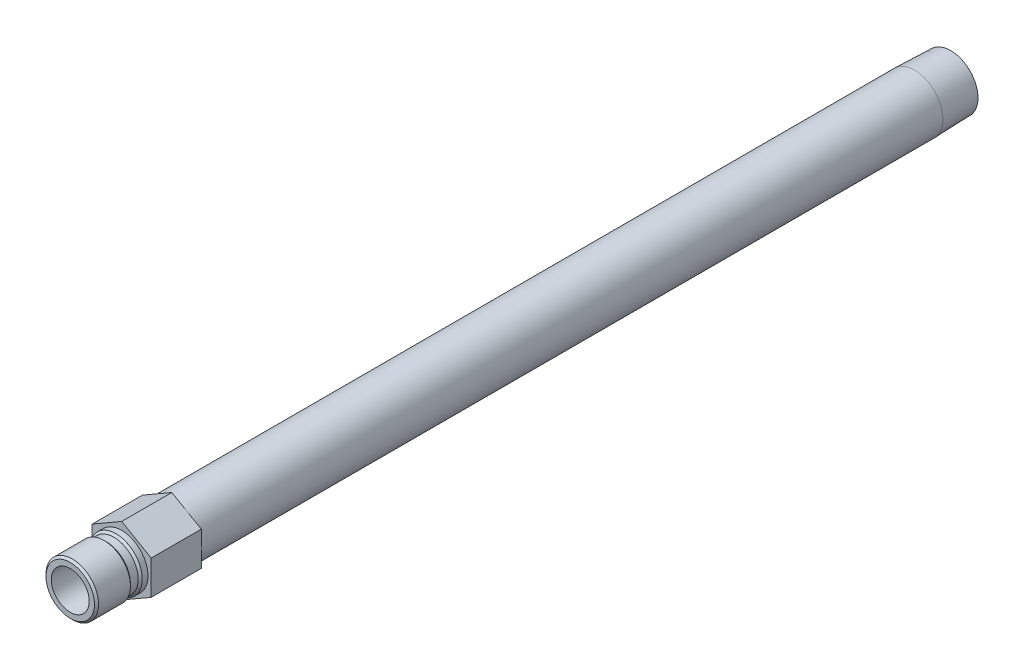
ISO-10303-21;
HEADER;
FILE_DESCRIPTION(('STEP AP214'),'2;1');
FILE_NAME('part.step','',(''),(''),'','','');
FILE_SCHEMA(('AUTOMOTIVE_DESIGN { 1 0 10303 214 1 1 1 1 }'));
ENDSEC;
DATA;
#1=APPLICATION_CONTEXT('core data for automotive mechanical design processes');
#2=APPLICATION_PROTOCOL_DEFINITION('international standard','automotive_design',2000,#1);
#3=PRODUCT_CONTEXT('',#1,'mechanical');
#4=PRODUCT('Part','Part','',(#3));
#5=PRODUCT_RELATED_PRODUCT_CATEGORY('part','',(#4));
#6=PRODUCT_DEFINITION_FORMATION('','',#4);
#7=PRODUCT_DEFINITION_CONTEXT('part definition',#1,'design');
#8=PRODUCT_DEFINITION('design','',#6,#7);
#9=PRODUCT_DEFINITION_SHAPE('','',#8);
#10=(LENGTH_UNIT() NAMED_UNIT(*) SI_UNIT(.MILLI.,.METRE.));
#11=(NAMED_UNIT(*) PLANE_ANGLE_UNIT() SI_UNIT($,.RADIAN.));
#12=(NAMED_UNIT(*) SI_UNIT($,.STERADIAN.) SOLID_ANGLE_UNIT());
#13=UNCERTAINTY_MEASURE_WITH_UNIT(LENGTH_MEASURE(1.E-05),#10,'distance_accuracy_value','');
#14=(GEOMETRIC_REPRESENTATION_CONTEXT(3) GLOBAL_UNCERTAINTY_ASSIGNED_CONTEXT((#13)) GLOBAL_UNIT_ASSIGNED_CONTEXT((#10,
#11,#12)) REPRESENTATION_CONTEXT('',''));
#15=CARTESIAN_POINT('',(0.,0.,0.));
#16=DIRECTION('',(0.,0.,1.));
#17=DIRECTION('',(1.,0.,0.));
#18=AXIS2_PLACEMENT_3D('',#15,#16,#17);
#19=CARTESIAN_POINT('',(0.,0.,0.));
#20=DIRECTION('',(0.,0.,-1.));
#21=DIRECTION('',(0.,1.,0.));
#22=AXIS2_PLACEMENT_3D('',#19,#20,#21);
#23=CYLINDRICAL_SURFACE('',#22,7.112);
#24=CARTESIAN_POINT('',(0.,0.,1.524));
#25=DIRECTION('',(0.,0.,-1.));
#26=DIRECTION('',(0.,1.,0.));
#27=AXIS2_PLACEMENT_3D('',#24,#25,#26);
#28=CIRCLE('',#27,7.112);
#29=CARTESIAN_POINT('',(0.,7.112,1.524));
#30=VERTEX_POINT('',#29);
#31=EDGE_CURVE('E147',#30,#30,#28,.T.);
#32=ORIENTED_EDGE('',*,*,#31,.T.);
#33=EDGE_LOOP('',(#32));
#34=FACE_BOUND('',#33,.T.);
#35=CARTESIAN_POINT('',(0.,0.,19.304));
#36=DIRECTION('',(0.,0.,-1.));
#37=DIRECTION('',(0.,1.,0.));
#38=AXIS2_PLACEMENT_3D('',#35,#36,#37);
#39=CIRCLE('',#38,7.112);
#40=CARTESIAN_POINT('',(0.,7.112,19.304));
#41=VERTEX_POINT('',#40);
#42=EDGE_CURVE('E42',#41,#41,#39,.T.);
#43=ORIENTED_EDGE('',*,*,#42,.F.);
#44=EDGE_LOOP('',(#43));
#45=FACE_BOUND('',#44,.T.);
#46=ADVANCED_FACE('F33',(#34,#45),#23,.F.);
#47=CARTESIAN_POINT('',(0.,7.112,19.304));
#48=DIRECTION('',(0.,0.,1.));
#49=DIRECTION('',(0.,-1.,0.));
#50=AXIS2_PLACEMENT_3D('',#47,#48,#49);
#51=PLANE('',#50);
#52=ORIENTED_EDGE('',*,*,#42,.T.);
#53=EDGE_LOOP('',(#52));
#54=FACE_BOUND('',#53,.T.);
#55=CARTESIAN_POINT('',(0.,0.,19.304));
#56=DIRECTION('',(0.,0.,-1.));
#57=DIRECTION('',(0.,1.,0.));
#58=AXIS2_PLACEMENT_3D('',#55,#56,#57);
#59=CIRCLE('',#58,9.0932);
#60=CARTESIAN_POINT('',(0.,9.0932,19.304));
#61=VERTEX_POINT('',#60);
#62=EDGE_CURVE('E180',#61,#61,#59,.T.);
#63=ORIENTED_EDGE('',*,*,#62,.F.);
#64=EDGE_LOOP('',(#63));
#65=FACE_BOUND('',#64,.T.);
#66=ADVANCED_FACE('F186',(#54,#65),#51,.T.);
#67=CARTESIAN_POINT('',(0.,0.,18.542));
#68=DIRECTION('',(0.,0.,-1.));
#69=DIRECTION('',(0.,1.,0.));
#70=AXIS2_PLACEMENT_3D('',#67,#68,#69);
#71=CONICAL_SURFACE('',#70,9.8552,0.785398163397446);
#72=ORIENTED_EDGE('',*,*,#62,.T.);
#73=EDGE_LOOP('',(#72));
#74=FACE_BOUND('',#73,.T.);
#75=CARTESIAN_POINT('',(0.,0.,18.542));
#76=DIRECTION('',(0.,0.,-1.));
#77=DIRECTION('',(0.,1.,0.));
#78=AXIS2_PLACEMENT_3D('',#75,#76,#77);
#79=CIRCLE('',#78,9.8552);
#80=CARTESIAN_POINT('',(0.,9.8552,18.542));
#81=VERTEX_POINT('',#80);
#82=EDGE_CURVE('E177',#81,#81,#79,.T.);
#83=ORIENTED_EDGE('',*,*,#82,.F.);
#84=EDGE_LOOP('',(#83));
#85=FACE_BOUND('',#84,.T.);
#86=ADVANCED_FACE('F194',(#74,#85),#71,.T.);
#87=CARTESIAN_POINT('',(0.,0.,0.));
#88=DIRECTION('',(0.,0.,-1.));
#89=DIRECTION('',(0.,1.,0.));
#90=AXIS2_PLACEMENT_3D('',#87,#88,#89);
#91=CYLINDRICAL_SURFACE('',#90,9.8552);
#92=ORIENTED_EDGE('',*,*,#82,.T.);
#93=EDGE_LOOP('',(#92));
#94=FACE_BOUND('',#93,.T.);
#95=CARTESIAN_POINT('',(0.,0.,6.5786));
#96=DIRECTION('',(0.,0.,-1.));
#97=DIRECTION('',(0.,1.,0.));
#98=AXIS2_PLACEMENT_3D('',#95,#96,#97);
#99=CIRCLE('',#98,9.8552);
#100=CARTESIAN_POINT('',(0.,9.8552,6.5786));
#101=VERTEX_POINT('',#100);
#102=EDGE_CURVE('E174',#101,#101,#99,.T.);
#103=ORIENTED_EDGE('',*,*,#102,.F.);
#104=EDGE_LOOP('',(#103));
#105=FACE_BOUND('',#104,.T.);
#106=ADVANCED_FACE('F249',(#94,#105),#91,.T.);
#107=CARTESIAN_POINT('',(0.,0.,5.8166));
#108=DIRECTION('',(0.,0.,1.));
#109=DIRECTION('',(0.,-1.,0.));
#110=AXIS2_PLACEMENT_3D('',#107,#108,#109);
#111=CONICAL_SURFACE('',#110,9.0932,0.785398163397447);
#112=ORIENTED_EDGE('',*,*,#102,.T.);
#113=EDGE_LOOP('',(#112));
#114=FACE_BOUND('',#113,.T.);
#115=CARTESIAN_POINT('',(0.,0.,5.8166));
#116=DIRECTION('',(0.,0.,-1.));
#117=DIRECTION('',(0.,1.,0.));
#118=AXIS2_PLACEMENT_3D('',#115,#116,#117);
#119=CIRCLE('',#118,9.0932);
#120=CARTESIAN_POINT('',(0.,9.0932,5.8166));
#121=VERTEX_POINT('',#120);
#122=EDGE_CURVE('E171',#121,#121,#119,.T.);
#123=ORIENTED_EDGE('',*,*,#122,.F.);
#124=EDGE_LOOP('',(#123));
#125=FACE_BOUND('',#124,.T.);
#126=ADVANCED_FACE('F245',(#114,#125),#111,.T.);
#127=CARTESIAN_POINT('',(0.,0.,0.));
#128=DIRECTION('',(0.,0.,-1.));
#129=DIRECTION('',(0.,1.,0.));
#130=AXIS2_PLACEMENT_3D('',#127,#128,#129);
#131=CYLINDRICAL_SURFACE('',#130,9.0932);
#132=ORIENTED_EDGE('',*,*,#122,.T.);
#133=EDGE_LOOP('',(#132));
#134=FACE_BOUND('',#133,.T.);
#135=CARTESIAN_POINT('',(0.,0.,2.921));
#136=DIRECTION('',(0.,0.,-1.));
#137=DIRECTION('',(0.,1.,0.));
#138=AXIS2_PLACEMENT_3D('',#135,#136,#137);
#139=CIRCLE('',#138,9.0932);
#140=CARTESIAN_POINT('',(0.,9.0932,2.921));
#141=VERTEX_POINT('',#140);
#142=EDGE_CURVE('E168',#141,#141,#139,.T.);
#143=ORIENTED_EDGE('',*,*,#142,.F.);
#144=EDGE_LOOP('',(#143));
#145=FACE_BOUND('',#144,.T.);
#146=ADVANCED_FACE('F241',(#134,#145),#131,.T.);
#147=CARTESIAN_POINT('',(0.,0.,2.159));
#148=DIRECTION('',(0.,0.,-1.));
#149=DIRECTION('',(0.,1.,0.));
#150=AXIS2_PLACEMENT_3D('',#147,#148,#149);
#151=CONICAL_SURFACE('',#150,9.8552,0.785398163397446);
#152=ORIENTED_EDGE('',*,*,#142,.T.);
#153=EDGE_LOOP('',(#152));
#154=FACE_BOUND('',#153,.T.);
#155=CARTESIAN_POINT('',(0.,0.,2.159));
#156=DIRECTION('',(0.,0.,-1.));
#157=DIRECTION('',(0.,1.,0.));
#158=AXIS2_PLACEMENT_3D('',#155,#156,#157);
#159=CIRCLE('',#158,9.8552);
#160=CARTESIAN_POINT('',(0.,9.8552,2.159));
#161=VERTEX_POINT('',#160);
#162=EDGE_CURVE('E165',#161,#161,#159,.T.);
#163=ORIENTED_EDGE('',*,*,#162,.F.);
#164=EDGE_LOOP('',(#163));
#165=FACE_BOUND('',#164,.T.);
#166=ADVANCED_FACE('F237',(#154,#165),#151,.T.);
#167=CARTESIAN_POINT('',(0.,0.,0.));
#168=DIRECTION('',(0.,0.,-1.));
#169=DIRECTION('',(0.,1.,0.));
#170=AXIS2_PLACEMENT_3D('',#167,#168,#169);
#171=CYLINDRICAL_SURFACE('',#170,9.8552);
#172=ORIENTED_EDGE('',*,*,#162,.T.);
#173=EDGE_LOOP('',(#172));
#174=FACE_BOUND('',#173,.T.);
#175=CARTESIAN_POINT('',(0.,0.,0.));
#176=DIRECTION('',(0.,0.,-1.));
#177=DIRECTION('',(0.,1.,0.));
#178=AXIS2_PLACEMENT_3D('',#175,#176,#177);
#179=CIRCLE('',#178,9.8552);
#180=CARTESIAN_POINT('',(0.,9.8552,0.));
#181=VERTEX_POINT('',#180);
#182=EDGE_CURVE('E162',#181,#181,#179,.T.);
#183=ORIENTED_EDGE('',*,*,#182,.F.);
#184=EDGE_LOOP('',(#183));
#185=FACE_BOUND('',#184,.T.);
#186=ADVANCED_FACE('F233',(#174,#185),#171,.T.);
#187=CARTESIAN_POINT('',(0.,9.8552,0.));
#188=DIRECTION('',(0.,0.,1.));
#189=DIRECTION('',(0.,-1.,0.));
#190=AXIS2_PLACEMENT_3D('',#187,#188,#189);
#191=PLANE('',#190);
#192=ORIENTED_EDGE('',*,*,#182,.T.);
#193=EDGE_LOOP('',(#192));
#194=FACE_BOUND('',#193,.T.);
#195=DIRECTION('',(-0.866025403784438,-0.5,0.));
#196=VECTOR('',#195,1.);
#197=CARTESIAN_POINT('',(0.,12.7582862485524,0.));
#198=LINE('',#197,#196);
#199=CARTESIAN_POINT('',(0.,12.7582862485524,0.));
#200=VERTEX_POINT('',#199);
#201=CARTESIAN_POINT('',(-11.049,6.37914312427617,0.));
#202=VERTEX_POINT('',#201);
#203=EDGE_CURVE('E121',#200,#202,#198,.T.);
#204=ORIENTED_EDGE('',*,*,#203,.T.);
#205=DIRECTION('',(0.,-1.,0.));
#206=VECTOR('',#205,1.);
#207=CARTESIAN_POINT('',(-11.049,6.37914312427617,0.));
#208=LINE('',#207,#206);
#209=CARTESIAN_POINT('',(-11.049,-6.37914312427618,0.));
#210=VERTEX_POINT('',#209);
#211=EDGE_CURVE('E124',#202,#210,#208,.T.);
#212=ORIENTED_EDGE('',*,*,#211,.T.);
#213=DIRECTION('',(0.866025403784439,-0.5,0.));
#214=VECTOR('',#213,1.);
#215=CARTESIAN_POINT('',(-11.049,-6.37914312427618,0.));
#216=LINE('',#215,#214);
#217=CARTESIAN_POINT('',(0.,-12.7582862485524,0.));
#218=VERTEX_POINT('',#217);
#219=EDGE_CURVE('E128',#210,#218,#216,.T.);
#220=ORIENTED_EDGE('',*,*,#219,.T.);
#221=DIRECTION('',(0.866025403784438,0.5,0.));
#222=VECTOR('',#221,1.);
#223=CARTESIAN_POINT('',(0.,-12.7582862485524,0.));
#224=LINE('',#223,#222);
#225=CARTESIAN_POINT('',(11.049,-6.37914312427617,0.));
#226=VERTEX_POINT('',#225);
#227=EDGE_CURVE('E131',#218,#226,#224,.T.);
#228=ORIENTED_EDGE('',*,*,#227,.T.);
#229=DIRECTION('',(0.,1.,0.));
#230=VECTOR('',#229,1.);
#231=CARTESIAN_POINT('',(11.049,-6.37914312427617,0.));
#232=LINE('',#231,#230);
#233=CARTESIAN_POINT('',(11.049,6.37914312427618,0.));
#234=VERTEX_POINT('',#233);
#235=EDGE_CURVE('E98',#226,#234,#232,.T.);
#236=ORIENTED_EDGE('',*,*,#235,.T.);
#237=DIRECTION('',(-0.866025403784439,0.5,0.));
#238=VECTOR('',#237,1.);
#239=CARTESIAN_POINT('',(11.049,6.37914312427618,0.));
#240=LINE('',#239,#238);
#241=EDGE_CURVE('E134',#234,#200,#240,.T.);
#242=ORIENTED_EDGE('',*,*,#241,.T.);
#243=EDGE_LOOP('',(#204,#212,#220,#228,#236,#242));
#244=FACE_BOUND('',#243,.T.);
#245=ADVANCED_FACE('F210',(#194,#244),#191,.T.);
#246=CARTESIAN_POINT('',(0.,0.,0.));
#247=DIRECTION('',(0.,0.,-1.));
#248=DIRECTION('',(0.,1.,0.));
#249=AXIS2_PLACEMENT_3D('',#246,#247,#248);
#250=CYLINDRICAL_SURFACE('',#249,7.89939999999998);
#251=CARTESIAN_POINT('',(0.,0.,0.));
#252=DIRECTION('',(0.,0.,1.));
#253=DIRECTION('',(1.,0.,0.));
#254=AXIS2_PLACEMENT_3D('',#251,#252,#253);
#255=CIRCLE('',#254,7.89939999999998);
#256=CARTESIAN_POINT('',(7.89939999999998,0.,0.));
#257=VERTEX_POINT('',#256);
#258=EDGE_CURVE('E11',#257,#257,#255,.T.);
#259=ORIENTED_EDGE('',*,*,#258,.F.);
#260=EDGE_LOOP('',(#259));
#261=FACE_BOUND('',#260,.T.);
#262=CARTESIAN_POINT('',(0.,0.,1.10533199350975));
#263=DIRECTION('',(0.,0.,-1.));
#264=DIRECTION('',(0.,1.,0.));
#265=AXIS2_PLACEMENT_3D('',#262,#263,#264);
#266=CIRCLE('',#265,7.8994);
#267=CARTESIAN_POINT('',(0.,7.8994,1.10533199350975));
#268=VERTEX_POINT('',#267);
#269=EDGE_CURVE('E150',#268,#268,#266,.T.);
#270=ORIENTED_EDGE('',*,*,#269,.F.);
#271=EDGE_LOOP('',(#270));
#272=FACE_BOUND('',#271,.T.);
#273=ADVANCED_FACE('F200',(#261,#272),#250,.F.);
#274=CARTESIAN_POINT('',(0.,0.,1.524));
#275=DIRECTION('',(0.,0.,-1.));
#276=DIRECTION('',(0.,1.,0.));
#277=AXIS2_PLACEMENT_3D('',#274,#275,#276);
#278=CONICAL_SURFACE('',#277,7.112,1.08210413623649);
#279=ORIENTED_EDGE('',*,*,#269,.T.);
#280=EDGE_LOOP('',(#279));
#281=FACE_BOUND('',#280,.T.);
#282=ORIENTED_EDGE('',*,*,#31,.F.);
#283=EDGE_LOOP('',(#282));
#284=FACE_BOUND('',#283,.T.);
#285=ADVANCED_FACE('F197',(#281,#284),#278,.F.);
#286=CARTESIAN_POINT('',(-11.049,6.37914312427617,-18.796));
#287=DIRECTION('',(0.,0.,1.));
#288=DIRECTION('',(1.,0.,0.));
#289=AXIS2_PLACEMENT_3D('',#286,#287,#288);
#290=PLANE('',#289);
#291=CARTESIAN_POINT('',(0.,0.,-18.796));
#292=DIRECTION('',(0.,0.,1.));
#293=DIRECTION('',(1.,0.,0.));
#294=AXIS2_PLACEMENT_3D('',#291,#292,#293);
#295=CIRCLE('',#294,7.89939999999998);
#296=CARTESIAN_POINT('',(7.89939999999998,0.,-18.796));
#297=VERTEX_POINT('',#296);
#298=EDGE_CURVE('E36',#297,#297,#295,.T.);
#299=ORIENTED_EDGE('',*,*,#298,.F.);
#300=EDGE_LOOP('',(#299));
#301=FACE_BOUND('',#300,.T.);
#302=CARTESIAN_POINT('',(0.,0.,-18.796));
#303=DIRECTION('',(0.,0.,1.));
#304=DIRECTION('',(1.,0.,0.));
#305=AXIS2_PLACEMENT_3D('',#302,#303,#304);
#306=CIRCLE('',#305,7.112);
#307=CARTESIAN_POINT('',(7.112,0.,-18.796));
#308=VERTEX_POINT('',#307);
#309=EDGE_CURVE('E125',#308,#308,#306,.T.);
#310=ORIENTED_EDGE('',*,*,#309,.T.);
#311=EDGE_LOOP('',(#310));
#312=FACE_BOUND('',#311,.T.);
#313=ADVANCED_FACE('F199',(#301,#312),#290,.F.);
#314=CARTESIAN_POINT('',(0.,0.,-18.796));
#315=DIRECTION('',(0.,0.,1.));
#316=DIRECTION('',(1.,0.,0.));
#317=AXIS2_PLACEMENT_3D('',#314,#315,#316);
#318=CYLINDRICAL_SURFACE('',#317,7.112);
#319=ORIENTED_EDGE('',*,*,#309,.F.);
#320=EDGE_LOOP('',(#319));
#321=FACE_BOUND('',#320,.T.);
#322=CARTESIAN_POINT('',(0.,0.,0.));
#323=DIRECTION('',(0.,0.,1.));
#324=DIRECTION('',(1.,0.,0.));
#325=AXIS2_PLACEMENT_3D('',#322,#323,#324);
#326=CIRCLE('',#325,7.112);
#327=CARTESIAN_POINT('',(7.112,0.,0.));
#328=VERTEX_POINT('',#327);
#329=EDGE_CURVE('E443',#328,#328,#326,.T.);
#330=ORIENTED_EDGE('',*,*,#329,.T.);
#331=EDGE_LOOP('',(#330));
#332=FACE_BOUND('',#331,.T.);
#333=ADVANCED_FACE('F207',(#321,#332),#318,.F.);
#334=CARTESIAN_POINT('',(-11.049,6.37914312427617,0.));
#335=DIRECTION('',(0.,0.,1.));
#336=DIRECTION('',(1.,0.,0.));
#337=AXIS2_PLACEMENT_3D('',#334,#335,#336);
#338=PLANE('',#337);
#339=ORIENTED_EDGE('',*,*,#258,.T.);
#340=EDGE_LOOP('',(#339));
#341=FACE_BOUND('',#340,.T.);
#342=ORIENTED_EDGE('',*,*,#329,.F.);
#343=EDGE_LOOP('',(#342));
#344=FACE_BOUND('',#343,.T.);
#345=ADVANCED_FACE('F221',(#341,#344),#338,.T.);
#346=CARTESIAN_POINT('',(0.,10.244140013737,-310.896));
#347=DIRECTION('',(0.,0.,-1.));
#348=DIRECTION('',(0.,1.,0.));
#349=AXIS2_PLACEMENT_3D('',#346,#347,#348);
#350=PLANE('',#349);
#351=CARTESIAN_POINT('',(0.,0.,-310.896));
#352=DIRECTION('',(0.,0.,-1.));
#353=DIRECTION('',(0.,1.,0.));
#354=AXIS2_PLACEMENT_3D('',#351,#352,#353);
#355=CIRCLE('',#354,10.2441400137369);
#356=CARTESIAN_POINT('',(0.,10.244140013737,-310.896));
#357=VERTEX_POINT('',#356);
#358=EDGE_CURVE('E156',#357,#357,#355,.T.);
#359=ORIENTED_EDGE('',*,*,#358,.T.);
#360=EDGE_LOOP('',(#359));
#361=FACE_BOUND('',#360,.T.);
#362=CARTESIAN_POINT('',(0.,0.,-310.896));
#363=DIRECTION('',(0.,0.,-1.));
#364=DIRECTION('',(0.,1.,0.));
#365=AXIS2_PLACEMENT_3D('',#362,#363,#364);
#366=CIRCLE('',#365,7.89939999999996);
#367=CARTESIAN_POINT('',(0.,7.8994,-310.896));
#368=VERTEX_POINT('',#367);
#369=EDGE_CURVE('E153',#368,#368,#366,.T.);
#370=ORIENTED_EDGE('',*,*,#369,.F.);
#371=EDGE_LOOP('',(#370));
#372=FACE_BOUND('',#371,.T.);
#373=ADVANCED_FACE('F218',(#361,#372),#350,.T.);
#374=ORIENTED_EDGE('',*,*,#369,.T.);
#375=EDGE_LOOP('',(#374));
#376=FACE_BOUND('',#375,.T.);
#377=ORIENTED_EDGE('',*,*,#298,.T.);
#378=EDGE_LOOP('',(#377));
#379=FACE_BOUND('',#378,.T.);
#380=ADVANCED_FACE('F213',(#376,#379),#250,.F.);
#381=CARTESIAN_POINT('',(0.,0.,-310.896));
#382=DIRECTION('',(0.,0.,1.));
#383=DIRECTION('',(0.,-1.,0.));
#384=AXIS2_PLACEMENT_3D('',#381,#382,#383);
#385=CONICAL_SURFACE('',#384,10.2441400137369,0.0312396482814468);
#386=CARTESIAN_POINT('',(0.,0.,-297.3324));
#387=DIRECTION('',(0.,0.,-1.));
#388=DIRECTION('',(0.,1.,0.));
#389=AXIS2_PLACEMENT_3D('',#386,#387,#388);
#390=CIRCLE('',#389,10.668);
#391=CARTESIAN_POINT('',(0.,10.668,-297.3324));
#392=VERTEX_POINT('',#391);
#393=EDGE_CURVE('E159',#392,#392,#390,.T.);
#394=ORIENTED_EDGE('',*,*,#393,.T.);
#395=EDGE_LOOP('',(#394));
#396=FACE_BOUND('',#395,.T.);
#397=ORIENTED_EDGE('',*,*,#358,.F.);
#398=EDGE_LOOP('',(#397));
#399=FACE_BOUND('',#398,.T.);
#400=ADVANCED_FACE('F223',(#396,#399),#385,.T.);
#401=CARTESIAN_POINT('',(0.,0.,0.));
#402=DIRECTION('',(0.,0.,-1.));
#403=DIRECTION('',(0.,1.,0.));
#404=AXIS2_PLACEMENT_3D('',#401,#402,#403);
#405=CYLINDRICAL_SURFACE('',#404,10.668);
#406=ORIENTED_EDGE('',*,*,#393,.F.);
#407=EDGE_LOOP('',(#406));
#408=FACE_BOUND('',#407,.T.);
#409=CARTESIAN_POINT('',(0.,0.,-18.796));
#410=DIRECTION('',(0.,0.,1.));
#411=DIRECTION('',(1.,0.,0.));
#412=AXIS2_PLACEMENT_3D('',#409,#410,#411);
#413=CIRCLE('',#412,10.668);
#414=CARTESIAN_POINT('',(10.668,0.,-18.796));
#415=VERTEX_POINT('',#414);
#416=EDGE_CURVE('E144',#415,#415,#413,.F.);
#417=ORIENTED_EDGE('',*,*,#416,.T.);
#418=EDGE_LOOP('',(#417));
#419=FACE_BOUND('',#418,.T.);
#420=ADVANCED_FACE('F226',(#408,#419),#405,.T.);
#421=ORIENTED_EDGE('',*,*,#416,.F.);
#422=EDGE_LOOP('',(#421));
#423=FACE_BOUND('',#422,.T.);
#424=DIRECTION('',(-0.866025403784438,-0.5,0.));
#425=VECTOR('',#424,1.);
#426=CARTESIAN_POINT('',(0.,12.7582862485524,-18.796));
#427=LINE('',#426,#425);
#428=CARTESIAN_POINT('',(0.,12.7582862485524,-18.796));
#429=VERTEX_POINT('',#428);
#430=CARTESIAN_POINT('',(-11.049,6.37914312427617,-18.796));
#431=VERTEX_POINT('',#430);
#432=EDGE_CURVE('E137',#429,#431,#427,.T.);
#433=ORIENTED_EDGE('',*,*,#432,.F.);
#434=DIRECTION('',(-0.866025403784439,0.5,0.));
#435=VECTOR('',#434,1.);
#436=CARTESIAN_POINT('',(11.049,6.37914312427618,-18.796));
#437=LINE('',#436,#435);
#438=CARTESIAN_POINT('',(11.049,6.37914312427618,-18.796));
#439=VERTEX_POINT('',#438);
#440=EDGE_CURVE('E111',#439,#429,#437,.T.);
#441=ORIENTED_EDGE('',*,*,#440,.F.);
#442=DIRECTION('',(0.,1.,0.));
#443=VECTOR('',#442,1.);
#444=CARTESIAN_POINT('',(11.049,-6.37914312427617,-18.796));
#445=LINE('',#444,#443);
#446=CARTESIAN_POINT('',(11.049,-6.37914312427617,-18.796));
#447=VERTEX_POINT('',#446);
#448=EDGE_CURVE('E96',#447,#439,#445,.T.);
#449=ORIENTED_EDGE('',*,*,#448,.F.);
#450=DIRECTION('',(0.866025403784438,0.5,0.));
#451=VECTOR('',#450,1.);
#452=CARTESIAN_POINT('',(0.,-12.7582862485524,-18.796));
#453=LINE('',#452,#451);
#454=CARTESIAN_POINT('',(0.,-12.7582862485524,-18.796));
#455=VERTEX_POINT('',#454);
#456=EDGE_CURVE('E109',#455,#447,#453,.T.);
#457=ORIENTED_EDGE('',*,*,#456,.F.);
#458=DIRECTION('',(0.866025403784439,-0.5,0.));
#459=VECTOR('',#458,1.);
#460=CARTESIAN_POINT('',(-11.049,-6.37914312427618,-18.796));
#461=LINE('',#460,#459);
#462=CARTESIAN_POINT('',(-11.049,-6.37914312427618,-18.796));
#463=VERTEX_POINT('',#462);
#464=EDGE_CURVE('E114',#463,#455,#461,.T.);
#465=ORIENTED_EDGE('',*,*,#464,.F.);
#466=DIRECTION('',(0.,-1.,0.));
#467=VECTOR('',#466,1.);
#468=CARTESIAN_POINT('',(-11.049,6.37914312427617,-18.796));
#469=LINE('',#468,#467);
#470=EDGE_CURVE('E116',#431,#463,#469,.T.);
#471=ORIENTED_EDGE('',*,*,#470,.F.);
#472=EDGE_LOOP('',(#433,#441,#449,#457,#465,#471));
#473=FACE_BOUND('',#472,.T.);
#474=ADVANCED_FACE('F107',(#423,#473),#290,.F.);
#475=CARTESIAN_POINT('',(0.,12.7582862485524,-18.796));
#476=DIRECTION('',(-0.5,0.866025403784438,0.));
#477=DIRECTION('',(-0.866025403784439,-0.5,0.));
#478=AXIS2_PLACEMENT_3D('',#475,#476,#477);
#479=PLANE('',#478);
#480=ORIENTED_EDGE('',*,*,#203,.F.);
#481=DIRECTION('',(0.,0.,1.));
#482=VECTOR('',#481,1.);
#483=CARTESIAN_POINT('',(0.,12.7582862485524,-18.796));
#484=LINE('',#483,#482);
#485=EDGE_CURVE('E50',#429,#200,#484,.T.);
#486=ORIENTED_EDGE('',*,*,#485,.F.);
#487=ORIENTED_EDGE('',*,*,#432,.T.);
#488=DIRECTION('',(0.,0.,1.));
#489=VECTOR('',#488,1.);
#490=CARTESIAN_POINT('',(-11.049,6.37914312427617,-18.796));
#491=LINE('',#490,#489);
#492=EDGE_CURVE('E85',#431,#202,#491,.T.);
#493=ORIENTED_EDGE('',*,*,#492,.T.);
#494=EDGE_LOOP('',(#480,#486,#487,#493));
#495=FACE_BOUND('',#494,.T.);
#496=ADVANCED_FACE('F215',(#495),#479,.T.);
#497=CARTESIAN_POINT('',(11.049,6.37914312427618,-18.796));
#498=DIRECTION('',(0.5,0.866025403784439,0.));
#499=DIRECTION('',(-0.866025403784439,0.5,0.));
#500=AXIS2_PLACEMENT_3D('',#497,#498,#499);
#501=PLANE('',#500);
#502=ORIENTED_EDGE('',*,*,#241,.F.);
#503=DIRECTION('',(0.,0.,1.));
#504=VECTOR('',#503,1.);
#505=CARTESIAN_POINT('',(11.049,6.37914312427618,-18.796));
#506=LINE('',#505,#504);
#507=EDGE_CURVE('E73',#439,#234,#506,.T.);
#508=ORIENTED_EDGE('',*,*,#507,.F.);
#509=ORIENTED_EDGE('',*,*,#440,.T.);
#510=ORIENTED_EDGE('',*,*,#485,.T.);
#511=EDGE_LOOP('',(#502,#508,#509,#510));
#512=FACE_BOUND('',#511,.T.);
#513=ADVANCED_FACE('F276',(#512),#501,.T.);
#514=CARTESIAN_POINT('',(11.049,-6.37914312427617,-18.796));
#515=DIRECTION('',(1.,0.,0.));
#516=DIRECTION('',(0.,1.,0.));
#517=AXIS2_PLACEMENT_3D('',#514,#515,#516);
#518=PLANE('',#517);
#519=ORIENTED_EDGE('',*,*,#235,.F.);
#520=DIRECTION('',(0.,0.,1.));
#521=VECTOR('',#520,1.);
#522=CARTESIAN_POINT('',(11.049,-6.37914312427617,-18.796));
#523=LINE('',#522,#521);
#524=EDGE_CURVE('E93',#447,#226,#523,.T.);
#525=ORIENTED_EDGE('',*,*,#524,.F.);
#526=ORIENTED_EDGE('',*,*,#448,.T.);
#527=ORIENTED_EDGE('',*,*,#507,.T.);
#528=EDGE_LOOP('',(#519,#525,#526,#527));
#529=FACE_BOUND('',#528,.T.);
#530=ADVANCED_FACE('F95',(#529),#518,.T.);
#531=CARTESIAN_POINT('',(0.,-12.7582862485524,-18.796));
#532=DIRECTION('',(0.5,-0.866025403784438,0.));
#533=DIRECTION('',(0.866025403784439,0.5,0.));
#534=AXIS2_PLACEMENT_3D('',#531,#532,#533);
#535=PLANE('',#534);
#536=ORIENTED_EDGE('',*,*,#227,.F.);
#537=DIRECTION('',(0.,0.,1.));
#538=VECTOR('',#537,1.);
#539=CARTESIAN_POINT('',(0.,-12.7582862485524,-18.796));
#540=LINE('',#539,#538);
#541=EDGE_CURVE('E103',#455,#218,#540,.T.);
#542=ORIENTED_EDGE('',*,*,#541,.F.);
#543=ORIENTED_EDGE('',*,*,#456,.T.);
#544=ORIENTED_EDGE('',*,*,#524,.T.);
#545=EDGE_LOOP('',(#536,#542,#543,#544));
#546=FACE_BOUND('',#545,.T.);
#547=ADVANCED_FACE('F113',(#546),#535,.T.);
#548=CARTESIAN_POINT('',(-11.049,-6.37914312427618,-18.796));
#549=DIRECTION('',(-0.5,-0.866025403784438,0.));
#550=DIRECTION('',(0.866025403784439,-0.5,0.));
#551=AXIS2_PLACEMENT_3D('',#548,#549,#550);
#552=PLANE('',#551);
#553=ORIENTED_EDGE('',*,*,#219,.F.);
#554=DIRECTION('',(0.,0.,1.));
#555=VECTOR('',#554,1.);
#556=CARTESIAN_POINT('',(-11.049,-6.37914312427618,-18.796));
#557=LINE('',#556,#555);
#558=EDGE_CURVE('E141',#463,#210,#557,.T.);
#559=ORIENTED_EDGE('',*,*,#558,.F.);
#560=ORIENTED_EDGE('',*,*,#464,.T.);
#561=ORIENTED_EDGE('',*,*,#541,.T.);
#562=EDGE_LOOP('',(#553,#559,#560,#561));
#563=FACE_BOUND('',#562,.T.);
#564=ADVANCED_FACE('F275',(#563),#552,.T.);
#565=CARTESIAN_POINT('',(-11.049,6.37914312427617,-18.796));
#566=DIRECTION('',(-1.,0.,0.));
#567=DIRECTION('',(0.,0.,1.));
#568=AXIS2_PLACEMENT_3D('',#565,#566,#567);
#569=PLANE('',#568);
#570=ORIENTED_EDGE('',*,*,#211,.F.);
#571=ORIENTED_EDGE('',*,*,#492,.F.);
#572=ORIENTED_EDGE('',*,*,#470,.T.);
#573=ORIENTED_EDGE('',*,*,#558,.T.);
#574=EDGE_LOOP('',(#570,#571,#572,#573));
#575=FACE_BOUND('',#574,.T.);
#576=ADVANCED_FACE('F272',(#575),#569,.T.);
#577=CLOSED_SHELL('',(#46,#66,#86,#106,#126,#146,#166,#186,#245,#273,#285,#313,#333,#345,#373,
#380,#400,#420,#474,#496,#513,#530,#547,#564,#576));
#578=MANIFOLD_SOLID_BREP('B2',#577);
#579=ADVANCED_BREP_SHAPE_REPRESENTATION('',(#18,#578),#14);
#580=SHAPE_DEFINITION_REPRESENTATION(#9,#579);
ENDSEC;
END-ISO-10303-21;
